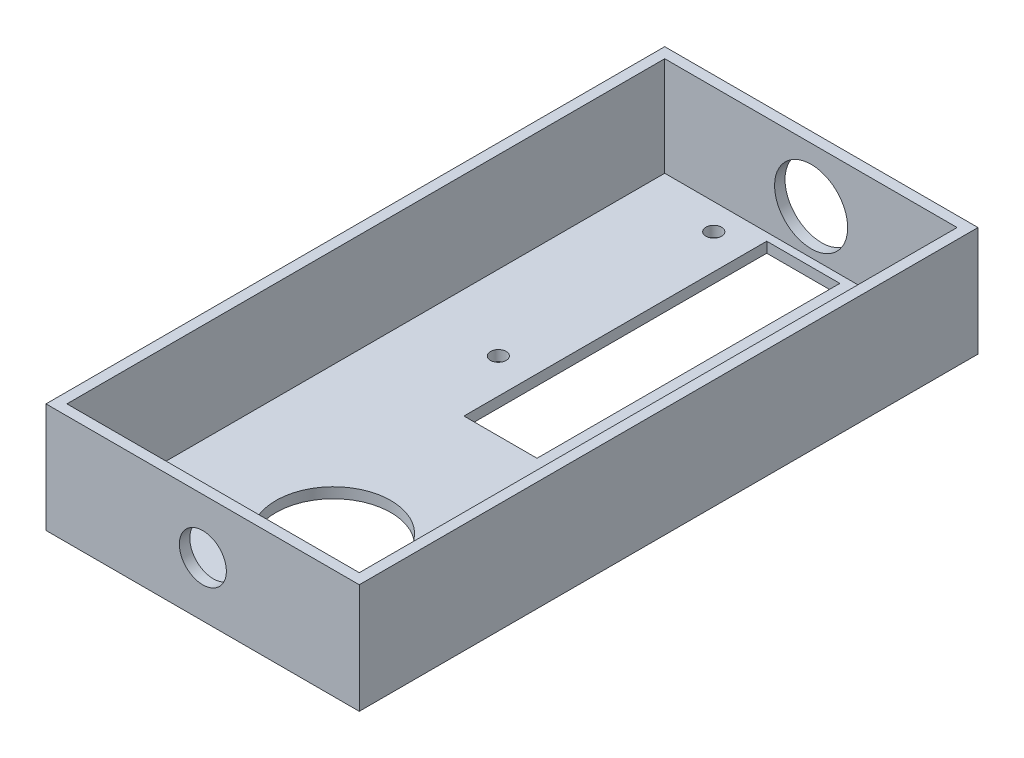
ISO-10303-21;
HEADER;
FILE_DESCRIPTION(('STEP AP214'),'2;1');
FILE_NAME('part.step','',(''),(''),'','','');
FILE_SCHEMA(('AUTOMOTIVE_DESIGN { 1 0 10303 214 1 1 1 1 }'));
ENDSEC;
DATA;
#1=APPLICATION_CONTEXT('core data for automotive mechanical design processes');
#2=APPLICATION_PROTOCOL_DEFINITION('international standard','automotive_design',2000,#1);
#3=PRODUCT_CONTEXT('',#1,'mechanical');
#4=PRODUCT('Part','Part','',(#3));
#5=PRODUCT_RELATED_PRODUCT_CATEGORY('part','',(#4));
#6=PRODUCT_DEFINITION_FORMATION('','',#4);
#7=PRODUCT_DEFINITION_CONTEXT('part definition',#1,'design');
#8=PRODUCT_DEFINITION('design','',#6,#7);
#9=PRODUCT_DEFINITION_SHAPE('','',#8);
#10=(LENGTH_UNIT() NAMED_UNIT(*) SI_UNIT(.MILLI.,.METRE.));
#11=(NAMED_UNIT(*) PLANE_ANGLE_UNIT() SI_UNIT($,.RADIAN.));
#12=(NAMED_UNIT(*) SI_UNIT($,.STERADIAN.) SOLID_ANGLE_UNIT());
#13=UNCERTAINTY_MEASURE_WITH_UNIT(LENGTH_MEASURE(1.E-05),#10,'distance_accuracy_value','');
#14=(GEOMETRIC_REPRESENTATION_CONTEXT(3) GLOBAL_UNCERTAINTY_ASSIGNED_CONTEXT((#13)) GLOBAL_UNIT_ASSIGNED_CONTEXT((#10,
#11,#12)) REPRESENTATION_CONTEXT('',''));
#15=CARTESIAN_POINT('',(0.,0.,0.));
#16=DIRECTION('',(0.,0.,1.));
#17=DIRECTION('',(1.,0.,0.));
#18=AXIS2_PLACEMENT_3D('',#15,#16,#17);
#19=CARTESIAN_POINT('',(0.,2.,0.));
#20=DIRECTION('',(0.,-1.,0.));
#21=DIRECTION('',(0.,0.,-1.));
#22=AXIS2_PLACEMENT_3D('',#19,#20,#21);
#23=PLANE('',#22);
#24=CARTESIAN_POINT('',(30.0395648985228,2.,-6.50255374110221));
#25=DIRECTION('',(0.,1.,0.));
#26=DIRECTION('',(0.,0.,1.));
#27=AXIS2_PLACEMENT_3D('',#24,#25,#26);
#28=CIRCLE('',#27,11.);
#29=CARTESIAN_POINT('',(30.0395648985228,2.,4.49744625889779));
#30=VERTEX_POINT('',#29);
#31=EDGE_CURVE('E184',#30,#30,#28,.T.);
#32=ORIENTED_EDGE('',*,*,#31,.F.);
#33=EDGE_LOOP('',(#32));
#34=FACE_BOUND('',#33,.T.);
#35=CARTESIAN_POINT('',(43.7551083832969,2.,-93.0025537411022));
#36=DIRECTION('',(0.,1.,0.));
#37=DIRECTION('',(0.,0.,1.));
#38=AXIS2_PLACEMENT_3D('',#35,#36,#37);
#39=CIRCLE('',#38,1.4999965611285);
#40=CARTESIAN_POINT('',(43.7551083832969,2.,-91.5025571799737));
#41=VERTEX_POINT('',#40);
#42=EDGE_CURVE('E196',#41,#41,#39,.T.);
#43=ORIENTED_EDGE('',*,*,#42,.F.);
#44=EDGE_LOOP('',(#43));
#45=FACE_BOUND('',#44,.T.);
#46=CARTESIAN_POINT('',(16.3670193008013,2.,-51.7685348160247));
#47=DIRECTION('',(0.,1.,0.));
#48=DIRECTION('',(0.,0.,1.));
#49=AXIS2_PLACEMENT_3D('',#46,#47,#48);
#50=CIRCLE('',#49,1.5);
#51=CARTESIAN_POINT('',(16.3670193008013,2.,-50.2685348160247));
#52=VERTEX_POINT('',#51);
#53=EDGE_CURVE('E195',#52,#52,#50,.T.);
#54=ORIENTED_EDGE('',*,*,#53,.F.);
#55=EDGE_LOOP('',(#54));
#56=FACE_BOUND('',#55,.T.);
#57=CARTESIAN_POINT('',(43.7389194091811,2.,-51.7685348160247));
#58=DIRECTION('',(0.,1.,0.));
#59=DIRECTION('',(0.,0.,1.));
#60=AXIS2_PLACEMENT_3D('',#57,#58,#59);
#61=CIRCLE('',#60,1.5);
#62=CARTESIAN_POINT('',(43.7389194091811,2.,-50.2685348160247));
#63=VERTEX_POINT('',#62);
#64=EDGE_CURVE('E190',#63,#63,#61,.T.);
#65=ORIENTED_EDGE('',*,*,#64,.F.);
#66=EDGE_LOOP('',(#65));
#67=FACE_BOUND('',#66,.T.);
#68=CARTESIAN_POINT('',(16.3883028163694,2.,-93.0025537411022));
#69=DIRECTION('',(0.,1.,0.));
#70=DIRECTION('',(0.,0.,1.));
#71=AXIS2_PLACEMENT_3D('',#68,#69,#70);
#72=CIRCLE('',#71,1.50500400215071);
#73=CARTESIAN_POINT('',(16.3883028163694,2.,-91.4975497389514));
#74=VERTEX_POINT('',#73);
#75=EDGE_CURVE('E199',#74,#74,#72,.T.);
#76=ORIENTED_EDGE('',*,*,#75,.F.);
#77=EDGE_LOOP('',(#76));
#78=FACE_BOUND('',#77,.T.);
#79=DIRECTION('',(1.,0.,0.));
#80=VECTOR('',#79,1.);
#81=CARTESIAN_POINT('',(23.0395648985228,2.,-38.5025537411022));
#82=LINE('',#81,#80);
#83=CARTESIAN_POINT('',(23.0395648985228,2.,-38.5025537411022));
#84=VERTEX_POINT('',#83);
#85=CARTESIAN_POINT('',(37.0395648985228,2.,-38.5025537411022));
#86=VERTEX_POINT('',#85);
#87=EDGE_CURVE('E215',#84,#86,#82,.T.);
#88=ORIENTED_EDGE('',*,*,#87,.F.);
#89=DIRECTION('',(0.,0.,1.));
#90=VECTOR('',#89,1.);
#91=CARTESIAN_POINT('',(23.0395648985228,2.,-96.5025537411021));
#92=LINE('',#91,#90);
#93=CARTESIAN_POINT('',(23.0395648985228,2.,-96.5025537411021));
#94=VERTEX_POINT('',#93);
#95=EDGE_CURVE('E213',#94,#84,#92,.T.);
#96=ORIENTED_EDGE('',*,*,#95,.F.);
#97=DIRECTION('',(-1.,0.,0.));
#98=VECTOR('',#97,1.);
#99=CARTESIAN_POINT('',(23.0395648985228,2.,-96.5025537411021));
#100=LINE('',#99,#98);
#101=CARTESIAN_POINT('',(37.0395648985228,2.,-96.5025537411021));
#102=VERTEX_POINT('',#101);
#103=EDGE_CURVE('E221',#102,#94,#100,.T.);
#104=ORIENTED_EDGE('',*,*,#103,.F.);
#105=DIRECTION('',(0.,0.,-1.));
#106=VECTOR('',#105,1.);
#107=CARTESIAN_POINT('',(37.0395648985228,2.,-96.5025537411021));
#108=LINE('',#107,#106);
#109=EDGE_CURVE('E218',#86,#102,#108,.T.);
#110=ORIENTED_EDGE('',*,*,#109,.F.);
#111=EDGE_LOOP('',(#88,#96,#104,#110));
#112=FACE_BOUND('',#111,.T.);
#113=DIRECTION('',(-1.,0.,0.));
#114=VECTOR('',#113,1.);
#115=CARTESIAN_POINT('',(0.,2.,16.4974462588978));
#116=LINE('',#115,#114);
#117=CARTESIAN_POINT('',(58.,2.,16.4974462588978));
#118=VERTEX_POINT('',#117);
#119=CARTESIAN_POINT('',(2.,2.,16.4974462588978));
#120=VERTEX_POINT('',#119);
#121=EDGE_CURVE('E176',#118,#120,#116,.T.);
#122=ORIENTED_EDGE('',*,*,#121,.F.);
#123=DIRECTION('',(0.,0.,1.));
#124=VECTOR('',#123,1.);
#125=CARTESIAN_POINT('',(58.,2.,40.));
#126=LINE('',#125,#124);
#127=CARTESIAN_POINT('',(58.,2.,-98.));
#128=VERTEX_POINT('',#127);
#129=EDGE_CURVE('E139',#128,#118,#126,.T.);
#130=ORIENTED_EDGE('',*,*,#129,.F.);
#131=DIRECTION('',(-1.,0.,0.));
#132=VECTOR('',#131,1.);
#133=CARTESIAN_POINT('',(60.,2.,-98.));
#134=LINE('',#133,#132);
#135=CARTESIAN_POINT('',(2.,2.,-98.));
#136=VERTEX_POINT('',#135);
#137=EDGE_CURVE('E138',#128,#136,#134,.T.);
#138=ORIENTED_EDGE('',*,*,#137,.T.);
#139=DIRECTION('',(0.,0.,-1.));
#140=VECTOR('',#139,1.);
#141=CARTESIAN_POINT('',(2.,2.,40.));
#142=LINE('',#141,#140);
#143=EDGE_CURVE('E182',#120,#136,#142,.T.);
#144=ORIENTED_EDGE('',*,*,#143,.F.);
#145=EDGE_LOOP('',(#122,#130,#138,#144));
#146=FACE_BOUND('',#145,.T.);
#147=ADVANCED_FACE('F43',(#34,#45,#56,#67,#78,#112,#146),#23,.F.);
#148=CARTESIAN_POINT('',(58.,32.,40.));
#149=DIRECTION('',(1.,0.,0.));
#150=DIRECTION('',(0.,0.,-1.));
#151=AXIS2_PLACEMENT_3D('',#148,#149,#150);
#152=PLANE('',#151);
#153=DIRECTION('',(0.,-1.,0.));
#154=VECTOR('',#153,1.);
#155=CARTESIAN_POINT('',(58.,32.,16.4974462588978));
#156=LINE('',#155,#154);
#157=CARTESIAN_POINT('',(58.,21.,16.4974462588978));
#158=VERTEX_POINT('',#157);
#159=EDGE_CURVE('E140',#158,#118,#156,.T.);
#160=ORIENTED_EDGE('',*,*,#159,.F.);
#161=DIRECTION('',(0.,0.,-1.));
#162=VECTOR('',#161,1.);
#163=CARTESIAN_POINT('',(58.,21.,16.4974462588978));
#164=LINE('',#163,#162);
#165=CARTESIAN_POINT('',(58.,21.,-98.));
#166=VERTEX_POINT('',#165);
#167=EDGE_CURVE('E143',#158,#166,#164,.T.);
#168=ORIENTED_EDGE('',*,*,#167,.T.);
#169=DIRECTION('',(0.,-1.,0.));
#170=VECTOR('',#169,1.);
#171=CARTESIAN_POINT('',(58.,32.,-98.));
#172=LINE('',#171,#170);
#173=EDGE_CURVE('E68',#166,#128,#172,.T.);
#174=ORIENTED_EDGE('',*,*,#173,.T.);
#175=ORIENTED_EDGE('',*,*,#129,.T.);
#176=EDGE_LOOP('',(#160,#168,#174,#175));
#177=FACE_BOUND('',#176,.T.);
#178=ADVANCED_FACE('F144',(#177),#152,.F.);
#179=CARTESIAN_POINT('',(2.,32.,40.));
#180=DIRECTION('',(-1.,0.,0.));
#181=DIRECTION('',(0.,0.,1.));
#182=AXIS2_PLACEMENT_3D('',#179,#180,#181);
#183=PLANE('',#182);
#184=DIRECTION('',(0.,-1.,0.));
#185=VECTOR('',#184,1.);
#186=CARTESIAN_POINT('',(2.,32.,-98.));
#187=LINE('',#186,#185);
#188=CARTESIAN_POINT('',(2.,21.,-98.));
#189=VERTEX_POINT('',#188);
#190=EDGE_CURVE('E60',#189,#136,#187,.T.);
#191=ORIENTED_EDGE('',*,*,#190,.F.);
#192=DIRECTION('',(0.,0.,1.));
#193=VECTOR('',#192,1.);
#194=CARTESIAN_POINT('',(2.,21.,16.4974462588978));
#195=LINE('',#194,#193);
#196=CARTESIAN_POINT('',(2.,21.,16.4974462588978));
#197=VERTEX_POINT('',#196);
#198=EDGE_CURVE('E151',#189,#197,#195,.T.);
#199=ORIENTED_EDGE('',*,*,#198,.T.);
#200=DIRECTION('',(0.,-1.,0.));
#201=VECTOR('',#200,1.);
#202=CARTESIAN_POINT('',(2.,32.,16.4974462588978));
#203=LINE('',#202,#201);
#204=EDGE_CURVE('E179',#197,#120,#203,.T.);
#205=ORIENTED_EDGE('',*,*,#204,.T.);
#206=ORIENTED_EDGE('',*,*,#143,.T.);
#207=EDGE_LOOP('',(#191,#199,#205,#206));
#208=FACE_BOUND('',#207,.T.);
#209=ADVANCED_FACE('F290',(#208),#183,.F.);
#210=CARTESIAN_POINT('',(0.,0.,-98.));
#211=DIRECTION('',(0.,0.,1.));
#212=DIRECTION('',(1.,0.,0.));
#213=AXIS2_PLACEMENT_3D('',#210,#211,#212);
#214=PLANE('',#213);
#215=ORIENTED_EDGE('',*,*,#173,.F.);
#216=DIRECTION('',(-1.,0.,0.));
#217=VECTOR('',#216,1.);
#218=CARTESIAN_POINT('',(58.,21.,-98.));
#219=LINE('',#218,#217);
#220=EDGE_CURVE('E135',#166,#189,#219,.T.);
#221=ORIENTED_EDGE('',*,*,#220,.T.);
#222=ORIENTED_EDGE('',*,*,#190,.T.);
#223=ORIENTED_EDGE('',*,*,#137,.F.);
#224=EDGE_LOOP('',(#215,#221,#222,#223));
#225=FACE_BOUND('',#224,.T.);
#226=CARTESIAN_POINT('',(30.0395648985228,10.5,-98.));
#227=DIRECTION('',(0.,0.,-1.));
#228=DIRECTION('',(-1.,0.,0.));
#229=AXIS2_PLACEMENT_3D('',#226,#227,#228);
#230=CIRCLE('',#229,7.);
#231=CARTESIAN_POINT('',(23.0395648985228,10.5,-98.));
#232=VERTEX_POINT('',#231);
#233=EDGE_CURVE('E205',#232,#232,#230,.T.);
#234=ORIENTED_EDGE('',*,*,#233,.T.);
#235=EDGE_LOOP('',(#234));
#236=FACE_BOUND('',#235,.T.);
#237=ADVANCED_FACE('F132',(#225,#236),#214,.T.);
#238=CARTESIAN_POINT('',(0.,2.,0.));
#239=DIRECTION('',(1.,0.,0.));
#240=DIRECTION('',(0.,0.,-1.));
#241=AXIS2_PLACEMENT_3D('',#238,#239,#240);
#242=PLANE('',#241);
#243=DIRECTION('',(0.,1.,0.));
#244=VECTOR('',#243,1.);
#245=CARTESIAN_POINT('',(0.,-2.00000000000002,18.5));
#246=LINE('',#245,#244);
#247=CARTESIAN_POINT('',(0.,0.,18.5));
#248=VERTEX_POINT('',#247);
#249=CARTESIAN_POINT('',(0.,21.,18.5));
#250=VERTEX_POINT('',#249);
#251=EDGE_CURVE('E170',#248,#250,#246,.T.);
#252=ORIENTED_EDGE('',*,*,#251,.T.);
#253=DIRECTION('',(0.,0.,1.));
#254=VECTOR('',#253,1.);
#255=CARTESIAN_POINT('',(0.,21.,-100.));
#256=LINE('',#255,#254);
#257=CARTESIAN_POINT('',(0.,21.,-100.));
#258=VERTEX_POINT('',#257);
#259=EDGE_CURVE('E157',#258,#250,#256,.T.);
#260=ORIENTED_EDGE('',*,*,#259,.F.);
#261=DIRECTION('',(0.,-1.,0.));
#262=VECTOR('',#261,1.);
#263=CARTESIAN_POINT('',(0.,2.,-100.));
#264=LINE('',#263,#262);
#265=CARTESIAN_POINT('',(0.,0.,-100.));
#266=VERTEX_POINT('',#265);
#267=EDGE_CURVE('E242',#258,#266,#264,.T.);
#268=ORIENTED_EDGE('',*,*,#267,.T.);
#269=DIRECTION('',(0.,0.,1.));
#270=VECTOR('',#269,1.);
#271=CARTESIAN_POINT('',(0.,0.,0.));
#272=LINE('',#271,#270);
#273=EDGE_CURVE('E227',#266,#248,#272,.T.);
#274=ORIENTED_EDGE('',*,*,#273,.T.);
#275=EDGE_LOOP('',(#252,#260,#268,#274));
#276=FACE_BOUND('',#275,.T.);
#277=ADVANCED_FACE('F45',(#276),#242,.F.);
#278=CARTESIAN_POINT('',(60.,2.,0.));
#279=DIRECTION('',(-1.,0.,0.));
#280=DIRECTION('',(0.,0.,1.));
#281=AXIS2_PLACEMENT_3D('',#278,#279,#280);
#282=PLANE('',#281);
#283=DIRECTION('',(0.,-1.,0.));
#284=VECTOR('',#283,1.);
#285=CARTESIAN_POINT('',(60.,2.,-100.));
#286=LINE('',#285,#284);
#287=CARTESIAN_POINT('',(60.,21.,-100.));
#288=VERTEX_POINT('',#287);
#289=CARTESIAN_POINT('',(60.,0.,-100.));
#290=VERTEX_POINT('',#289);
#291=EDGE_CURVE('E244',#288,#290,#286,.T.);
#292=ORIENTED_EDGE('',*,*,#291,.F.);
#293=DIRECTION('',(0.,0.,-1.));
#294=VECTOR('',#293,1.);
#295=CARTESIAN_POINT('',(60.,21.,-100.));
#296=LINE('',#295,#294);
#297=CARTESIAN_POINT('',(60.,21.,18.5));
#298=VERTEX_POINT('',#297);
#299=EDGE_CURVE('E163',#298,#288,#296,.T.);
#300=ORIENTED_EDGE('',*,*,#299,.F.);
#301=DIRECTION('',(0.,1.,0.));
#302=VECTOR('',#301,1.);
#303=CARTESIAN_POINT('',(60.,-2.00000000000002,18.5));
#304=LINE('',#303,#302);
#305=CARTESIAN_POINT('',(60.,0.,18.5));
#306=VERTEX_POINT('',#305);
#307=EDGE_CURVE('E169',#306,#298,#304,.T.);
#308=ORIENTED_EDGE('',*,*,#307,.F.);
#309=DIRECTION('',(0.,0.,-1.));
#310=VECTOR('',#309,1.);
#311=CARTESIAN_POINT('',(60.,0.,0.));
#312=LINE('',#311,#310);
#313=EDGE_CURVE('E236',#306,#290,#312,.T.);
#314=ORIENTED_EDGE('',*,*,#313,.T.);
#315=EDGE_LOOP('',(#292,#300,#308,#314));
#316=FACE_BOUND('',#315,.T.);
#317=ADVANCED_FACE('F303',(#316),#282,.F.);
#318=CARTESIAN_POINT('',(0.,2.,-100.));
#319=DIRECTION('',(0.,0.,1.));
#320=DIRECTION('',(1.,0.,0.));
#321=AXIS2_PLACEMENT_3D('',#318,#319,#320);
#322=PLANE('',#321);
#323=ORIENTED_EDGE('',*,*,#267,.F.);
#324=DIRECTION('',(-1.,0.,0.));
#325=VECTOR('',#324,1.);
#326=CARTESIAN_POINT('',(0.,21.,-100.));
#327=LINE('',#326,#325);
#328=EDGE_CURVE('E166',#288,#258,#327,.T.);
#329=ORIENTED_EDGE('',*,*,#328,.F.);
#330=ORIENTED_EDGE('',*,*,#291,.T.);
#331=DIRECTION('',(-1.,0.,0.));
#332=VECTOR('',#331,1.);
#333=CARTESIAN_POINT('',(0.,0.,-100.));
#334=LINE('',#333,#332);
#335=EDGE_CURVE('E239',#290,#266,#334,.T.);
#336=ORIENTED_EDGE('',*,*,#335,.T.);
#337=EDGE_LOOP('',(#323,#329,#330,#336));
#338=FACE_BOUND('',#337,.T.);
#339=CARTESIAN_POINT('',(30.0395648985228,10.5,-100.));
#340=DIRECTION('',(0.,0.,-1.));
#341=DIRECTION('',(-1.,0.,0.));
#342=AXIS2_PLACEMENT_3D('',#339,#340,#341);
#343=CIRCLE('',#342,7.);
#344=CARTESIAN_POINT('',(23.0395648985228,10.5,-100.));
#345=VERTEX_POINT('',#344);
#346=EDGE_CURVE('E208',#345,#345,#343,.T.);
#347=ORIENTED_EDGE('',*,*,#346,.F.);
#348=EDGE_LOOP('',(#347));
#349=FACE_BOUND('',#348,.T.);
#350=ADVANCED_FACE('F300',(#338,#349),#322,.F.);
#351=CARTESIAN_POINT('',(0.,0.,0.));
#352=DIRECTION('',(0.,-1.,0.));
#353=DIRECTION('',(0.,0.,-1.));
#354=AXIS2_PLACEMENT_3D('',#351,#352,#353);
#355=PLANE('',#354);
#356=DIRECTION('',(1.,0.,0.));
#357=VECTOR('',#356,1.);
#358=CARTESIAN_POINT('',(0.,0.,18.5));
#359=LINE('',#358,#357);
#360=EDGE_CURVE('E173',#248,#306,#359,.T.);
#361=ORIENTED_EDGE('',*,*,#360,.F.);
#362=ORIENTED_EDGE('',*,*,#273,.F.);
#363=ORIENTED_EDGE('',*,*,#335,.F.);
#364=ORIENTED_EDGE('',*,*,#313,.F.);
#365=EDGE_LOOP('',(#361,#362,#363,#364));
#366=FACE_BOUND('',#365,.T.);
#367=CARTESIAN_POINT('',(30.0395648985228,0.,-6.50255374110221));
#368=DIRECTION('',(0.,1.,0.));
#369=DIRECTION('',(0.,0.,1.));
#370=AXIS2_PLACEMENT_3D('',#367,#368,#369);
#371=CIRCLE('',#370,11.);
#372=CARTESIAN_POINT('',(30.0395648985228,0.,4.49744625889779));
#373=VERTEX_POINT('',#372);
#374=EDGE_CURVE('E187',#373,#373,#371,.T.);
#375=ORIENTED_EDGE('',*,*,#374,.T.);
#376=EDGE_LOOP('',(#375));
#377=FACE_BOUND('',#376,.T.);
#378=CARTESIAN_POINT('',(43.7551083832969,0.,-93.0025537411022));
#379=DIRECTION('',(0.,-1.,0.));
#380=DIRECTION('',(0.,0.,-1.));
#381=AXIS2_PLACEMENT_3D('',#378,#379,#380);
#382=CIRCLE('',#381,1.4999965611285);
#383=CARTESIAN_POINT('',(43.7551083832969,0.,-94.5025503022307));
#384=VERTEX_POINT('',#383);
#385=EDGE_CURVE('E211',#384,#384,#382,.T.);
#386=ORIENTED_EDGE('',*,*,#385,.F.);
#387=EDGE_LOOP('',(#386));
#388=FACE_BOUND('',#387,.T.);
#389=CARTESIAN_POINT('',(16.3670193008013,0.,-51.7685348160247));
#390=DIRECTION('',(0.,-1.,0.));
#391=DIRECTION('',(0.,0.,-1.));
#392=AXIS2_PLACEMENT_3D('',#389,#390,#391);
#393=CIRCLE('',#392,1.5);
#394=CARTESIAN_POINT('',(16.3670193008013,0.,-53.2685348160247));
#395=VERTEX_POINT('',#394);
#396=EDGE_CURVE('E257',#395,#395,#393,.T.);
#397=ORIENTED_EDGE('',*,*,#396,.F.);
#398=EDGE_LOOP('',(#397));
#399=FACE_BOUND('',#398,.T.);
#400=CARTESIAN_POINT('',(43.7389194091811,0.,-51.7685348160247));
#401=DIRECTION('',(0.,-1.,0.));
#402=DIRECTION('',(0.,0.,-1.));
#403=AXIS2_PLACEMENT_3D('',#400,#401,#402);
#404=CIRCLE('',#403,1.5);
#405=CARTESIAN_POINT('',(43.7389194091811,0.,-53.2685348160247));
#406=VERTEX_POINT('',#405);
#407=EDGE_CURVE('E254',#406,#406,#404,.T.);
#408=ORIENTED_EDGE('',*,*,#407,.F.);
#409=EDGE_LOOP('',(#408));
#410=FACE_BOUND('',#409,.T.);
#411=CARTESIAN_POINT('',(16.3883028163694,0.,-93.0025537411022));
#412=DIRECTION('',(0.,-1.,0.));
#413=DIRECTION('',(0.,0.,-1.));
#414=AXIS2_PLACEMENT_3D('',#411,#412,#413);
#415=CIRCLE('',#414,1.50500400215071);
#416=CARTESIAN_POINT('',(16.3883028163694,0.,-94.5075577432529));
#417=VERTEX_POINT('',#416);
#418=EDGE_CURVE('E204',#417,#417,#415,.T.);
#419=ORIENTED_EDGE('',*,*,#418,.F.);
#420=EDGE_LOOP('',(#419));
#421=FACE_BOUND('',#420,.T.);
#422=DIRECTION('',(0.,0.,-1.));
#423=VECTOR('',#422,1.);
#424=CARTESIAN_POINT('',(23.0395648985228,0.,0.));
#425=LINE('',#424,#423);
#426=CARTESIAN_POINT('',(23.0395648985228,0.,-38.5025537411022));
#427=VERTEX_POINT('',#426);
#428=CARTESIAN_POINT('',(23.0395648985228,0.,-96.5025537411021));
#429=VERTEX_POINT('',#428);
#430=EDGE_CURVE('E11',#427,#429,#425,.T.);
#431=ORIENTED_EDGE('',*,*,#430,.F.);
#432=DIRECTION('',(-1.,0.,0.));
#433=VECTOR('',#432,1.);
#434=CARTESIAN_POINT('',(0.,0.,-38.5025537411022));
#435=LINE('',#434,#433);
#436=CARTESIAN_POINT('',(37.0395648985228,0.,-38.5025537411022));
#437=VERTEX_POINT('',#436);
#438=EDGE_CURVE('E246',#437,#427,#435,.T.);
#439=ORIENTED_EDGE('',*,*,#438,.F.);
#440=DIRECTION('',(0.,0.,1.));
#441=VECTOR('',#440,1.);
#442=CARTESIAN_POINT('',(37.0395648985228,0.,0.));
#443=LINE('',#442,#441);
#444=CARTESIAN_POINT('',(37.0395648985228,0.,-96.5025537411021));
#445=VERTEX_POINT('',#444);
#446=EDGE_CURVE('E248',#445,#437,#443,.T.);
#447=ORIENTED_EDGE('',*,*,#446,.F.);
#448=DIRECTION('',(1.,0.,0.));
#449=VECTOR('',#448,1.);
#450=CARTESIAN_POINT('',(0.,0.,-96.5025537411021));
#451=LINE('',#450,#449);
#452=EDGE_CURVE('E52',#429,#445,#451,.T.);
#453=ORIENTED_EDGE('',*,*,#452,.F.);
#454=EDGE_LOOP('',(#431,#439,#447,#453));
#455=FACE_BOUND('',#454,.T.);
#456=ADVANCED_FACE('F298',(#366,#377,#388,#399,#410,#421,#455),#355,.T.);
#457=CARTESIAN_POINT('',(23.0395648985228,-8.,-96.5025537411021));
#458=DIRECTION('',(-1.,0.,0.));
#459=DIRECTION('',(0.,0.,1.));
#460=AXIS2_PLACEMENT_3D('',#457,#458,#459);
#461=PLANE('',#460);
#462=ORIENTED_EDGE('',*,*,#430,.T.);
#463=DIRECTION('',(0.,1.,0.));
#464=VECTOR('',#463,1.);
#465=CARTESIAN_POINT('',(23.0395648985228,-8.,-96.5025537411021));
#466=LINE('',#465,#464);
#467=EDGE_CURVE('E225',#429,#94,#466,.T.);
#468=ORIENTED_EDGE('',*,*,#467,.T.);
#469=ORIENTED_EDGE('',*,*,#95,.T.);
#470=DIRECTION('',(0.,1.,0.));
#471=VECTOR('',#470,1.);
#472=CARTESIAN_POINT('',(23.0395648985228,-8.,-38.5025537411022));
#473=LINE('',#472,#471);
#474=EDGE_CURVE('E224',#427,#84,#473,.T.);
#475=ORIENTED_EDGE('',*,*,#474,.F.);
#476=EDGE_LOOP('',(#462,#468,#469,#475));
#477=FACE_BOUND('',#476,.T.);
#478=ADVANCED_FACE('F296',(#477),#461,.F.);
#479=CARTESIAN_POINT('',(23.0395648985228,-8.,-96.5025537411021));
#480=DIRECTION('',(0.,0.,-1.));
#481=DIRECTION('',(-1.,0.,0.));
#482=AXIS2_PLACEMENT_3D('',#479,#480,#481);
#483=PLANE('',#482);
#484=ORIENTED_EDGE('',*,*,#452,.T.);
#485=DIRECTION('',(0.,1.,0.));
#486=VECTOR('',#485,1.);
#487=CARTESIAN_POINT('',(37.0395648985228,-8.,-96.5025537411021));
#488=LINE('',#487,#486);
#489=EDGE_CURVE('E228',#445,#102,#488,.T.);
#490=ORIENTED_EDGE('',*,*,#489,.T.);
#491=ORIENTED_EDGE('',*,*,#103,.T.);
#492=ORIENTED_EDGE('',*,*,#467,.F.);
#493=EDGE_LOOP('',(#484,#490,#491,#492));
#494=FACE_BOUND('',#493,.T.);
#495=ADVANCED_FACE('F343',(#494),#483,.F.);
#496=CARTESIAN_POINT('',(37.0395648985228,-8.,-96.5025537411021));
#497=DIRECTION('',(1.,0.,0.));
#498=DIRECTION('',(0.,0.,-1.));
#499=AXIS2_PLACEMENT_3D('',#496,#497,#498);
#500=PLANE('',#499);
#501=ORIENTED_EDGE('',*,*,#446,.T.);
#502=DIRECTION('',(0.,1.,0.));
#503=VECTOR('',#502,1.);
#504=CARTESIAN_POINT('',(37.0395648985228,-8.,-38.5025537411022));
#505=LINE('',#504,#503);
#506=EDGE_CURVE('E230',#437,#86,#505,.T.);
#507=ORIENTED_EDGE('',*,*,#506,.T.);
#508=ORIENTED_EDGE('',*,*,#109,.T.);
#509=ORIENTED_EDGE('',*,*,#489,.F.);
#510=EDGE_LOOP('',(#501,#507,#508,#509));
#511=FACE_BOUND('',#510,.T.);
#512=ADVANCED_FACE('F354',(#511),#500,.F.);
#513=CARTESIAN_POINT('',(23.0395648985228,-8.,-38.5025537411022));
#514=DIRECTION('',(0.,0.,1.));
#515=DIRECTION('',(1.,0.,0.));
#516=AXIS2_PLACEMENT_3D('',#513,#514,#515);
#517=PLANE('',#516);
#518=ORIENTED_EDGE('',*,*,#438,.T.);
#519=ORIENTED_EDGE('',*,*,#474,.T.);
#520=ORIENTED_EDGE('',*,*,#87,.T.);
#521=ORIENTED_EDGE('',*,*,#506,.F.);
#522=EDGE_LOOP('',(#518,#519,#520,#521));
#523=FACE_BOUND('',#522,.T.);
#524=ADVANCED_FACE('F352',(#523),#517,.F.);
#525=CARTESIAN_POINT('',(30.0395648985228,10.5,-98.));
#526=DIRECTION('',(0.,0.,-1.));
#527=DIRECTION('',(-1.,0.,0.));
#528=AXIS2_PLACEMENT_3D('',#525,#526,#527);
#529=CYLINDRICAL_SURFACE('',#528,7.);
#530=ORIENTED_EDGE('',*,*,#233,.F.);
#531=EDGE_LOOP('',(#530));
#532=FACE_BOUND('',#531,.T.);
#533=ORIENTED_EDGE('',*,*,#346,.T.);
#534=EDGE_LOOP('',(#533));
#535=FACE_BOUND('',#534,.T.);
#536=ADVANCED_FACE('F361',(#532,#535),#529,.F.);
#537=CARTESIAN_POINT('',(16.3883028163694,-1.,-93.0025537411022));
#538=DIRECTION('',(0.,1.,0.));
#539=DIRECTION('',(0.,0.,1.));
#540=AXIS2_PLACEMENT_3D('',#537,#538,#539);
#541=CYLINDRICAL_SURFACE('',#540,1.50500400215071);
#542=ORIENTED_EDGE('',*,*,#418,.T.);
#543=EDGE_LOOP('',(#542));
#544=FACE_BOUND('',#543,.T.);
#545=ORIENTED_EDGE('',*,*,#75,.T.);
#546=EDGE_LOOP('',(#545));
#547=FACE_BOUND('',#546,.T.);
#548=ADVANCED_FACE('F368',(#544,#547),#541,.F.);
#549=CARTESIAN_POINT('',(43.7389194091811,-1.,-51.7685348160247));
#550=DIRECTION('',(0.,1.,0.));
#551=DIRECTION('',(0.,0.,1.));
#552=AXIS2_PLACEMENT_3D('',#549,#550,#551);
#553=CYLINDRICAL_SURFACE('',#552,1.5);
#554=ORIENTED_EDGE('',*,*,#407,.T.);
#555=EDGE_LOOP('',(#554));
#556=FACE_BOUND('',#555,.T.);
#557=ORIENTED_EDGE('',*,*,#64,.T.);
#558=EDGE_LOOP('',(#557));
#559=FACE_BOUND('',#558,.T.);
#560=ADVANCED_FACE('F372',(#556,#559),#553,.F.);
#561=CARTESIAN_POINT('',(16.3670193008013,-1.,-51.7685348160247));
#562=DIRECTION('',(0.,1.,0.));
#563=DIRECTION('',(0.,0.,1.));
#564=AXIS2_PLACEMENT_3D('',#561,#562,#563);
#565=CYLINDRICAL_SURFACE('',#564,1.5);
#566=ORIENTED_EDGE('',*,*,#396,.T.);
#567=EDGE_LOOP('',(#566));
#568=FACE_BOUND('',#567,.T.);
#569=ORIENTED_EDGE('',*,*,#53,.T.);
#570=EDGE_LOOP('',(#569));
#571=FACE_BOUND('',#570,.T.);
#572=ADVANCED_FACE('F374',(#568,#571),#565,.F.);
#573=CARTESIAN_POINT('',(43.7551083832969,-1.,-93.0025537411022));
#574=DIRECTION('',(0.,1.,0.));
#575=DIRECTION('',(0.,0.,1.));
#576=AXIS2_PLACEMENT_3D('',#573,#574,#575);
#577=CYLINDRICAL_SURFACE('',#576,1.4999965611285);
#578=ORIENTED_EDGE('',*,*,#385,.T.);
#579=EDGE_LOOP('',(#578));
#580=FACE_BOUND('',#579,.T.);
#581=ORIENTED_EDGE('',*,*,#42,.T.);
#582=EDGE_LOOP('',(#581));
#583=FACE_BOUND('',#582,.T.);
#584=ADVANCED_FACE('F280',(#580,#583),#577,.F.);
#585=CARTESIAN_POINT('',(30.0395648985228,0.,-6.50255374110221));
#586=DIRECTION('',(0.,1.,0.));
#587=DIRECTION('',(0.,0.,1.));
#588=AXIS2_PLACEMENT_3D('',#585,#586,#587);
#589=CYLINDRICAL_SURFACE('',#588,11.);
#590=ORIENTED_EDGE('',*,*,#374,.F.);
#591=EDGE_LOOP('',(#590));
#592=FACE_BOUND('',#591,.T.);
#593=ORIENTED_EDGE('',*,*,#31,.T.);
#594=EDGE_LOOP('',(#593));
#595=FACE_BOUND('',#594,.T.);
#596=ADVANCED_FACE('F269',(#592,#595),#589,.F.);
#597=CARTESIAN_POINT('',(30.0395648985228,10.5,42.));
#598=DIRECTION('',(0.,0.,-1.));
#599=DIRECTION('',(-1.,0.,0.));
#600=AXIS2_PLACEMENT_3D('',#597,#598,#599);
#601=CYLINDRICAL_SURFACE('',#600,4.5);
#602=CARTESIAN_POINT('',(30.0395648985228,10.5,18.5));
#603=DIRECTION('',(0.,0.,-1.));
#604=DIRECTION('',(-1.,0.,0.));
#605=AXIS2_PLACEMENT_3D('',#602,#603,#604);
#606=CIRCLE('',#605,4.5);
#607=CARTESIAN_POINT('',(25.5395648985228,10.5,18.5));
#608=VERTEX_POINT('',#607);
#609=EDGE_CURVE('E47',#608,#608,#606,.F.);
#610=ORIENTED_EDGE('',*,*,#609,.T.);
#611=EDGE_LOOP('',(#610));
#612=FACE_BOUND('',#611,.T.);
#613=CARTESIAN_POINT('',(30.0395648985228,10.5,16.4974462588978));
#614=DIRECTION('',(0.,0.,1.));
#615=DIRECTION('',(1.,0.,0.));
#616=AXIS2_PLACEMENT_3D('',#613,#614,#615);
#617=CIRCLE('',#616,4.5);
#618=CARTESIAN_POINT('',(34.5395648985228,10.5,16.4974462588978));
#619=VERTEX_POINT('',#618);
#620=EDGE_CURVE('E175',#619,#619,#617,.T.);
#621=ORIENTED_EDGE('',*,*,#620,.F.);
#622=EDGE_LOOP('',(#621));
#623=FACE_BOUND('',#622,.T.);
#624=ADVANCED_FACE('F267',(#612,#623),#601,.F.);
#625=CARTESIAN_POINT('',(0.,32.,16.4974462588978));
#626=DIRECTION('',(0.,0.,1.));
#627=DIRECTION('',(1.,0.,0.));
#628=AXIS2_PLACEMENT_3D('',#625,#626,#627);
#629=PLANE('',#628);
#630=ORIENTED_EDGE('',*,*,#620,.T.);
#631=EDGE_LOOP('',(#630));
#632=FACE_BOUND('',#631,.T.);
#633=ORIENTED_EDGE('',*,*,#204,.F.);
#634=DIRECTION('',(1.,0.,0.));
#635=VECTOR('',#634,1.);
#636=CARTESIAN_POINT('',(58.,21.,16.4974462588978));
#637=LINE('',#636,#635);
#638=EDGE_CURVE('E153',#197,#158,#637,.T.);
#639=ORIENTED_EDGE('',*,*,#638,.T.);
#640=ORIENTED_EDGE('',*,*,#159,.T.);
#641=ORIENTED_EDGE('',*,*,#121,.T.);
#642=EDGE_LOOP('',(#633,#639,#640,#641));
#643=FACE_BOUND('',#642,.T.);
#644=ADVANCED_FACE('F264',(#632,#643),#629,.F.);
#645=CARTESIAN_POINT('',(60.,-2.00000000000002,18.5));
#646=DIRECTION('',(0.,0.,-1.));
#647=DIRECTION('',(-1.,0.,0.));
#648=AXIS2_PLACEMENT_3D('',#645,#646,#647);
#649=PLANE('',#648);
#650=ORIENTED_EDGE('',*,*,#307,.T.);
#651=DIRECTION('',(1.,0.,0.));
#652=VECTOR('',#651,1.);
#653=CARTESIAN_POINT('',(0.,21.,18.5));
#654=LINE('',#653,#652);
#655=EDGE_CURVE('E160',#250,#298,#654,.T.);
#656=ORIENTED_EDGE('',*,*,#655,.F.);
#657=ORIENTED_EDGE('',*,*,#251,.F.);
#658=ORIENTED_EDGE('',*,*,#360,.T.);
#659=EDGE_LOOP('',(#650,#656,#657,#658));
#660=FACE_BOUND('',#659,.T.);
#661=ORIENTED_EDGE('',*,*,#609,.F.);
#662=EDGE_LOOP('',(#661));
#663=FACE_BOUND('',#662,.T.);
#664=ADVANCED_FACE('F277',(#660,#663),#649,.F.);
#665=CARTESIAN_POINT('',(0.,21.,0.));
#666=DIRECTION('',(0.,1.,0.));
#667=DIRECTION('',(-1.,0.,0.));
#668=AXIS2_PLACEMENT_3D('',#665,#666,#667);
#669=PLANE('',#668);
#670=ORIENTED_EDGE('',*,*,#259,.T.);
#671=ORIENTED_EDGE('',*,*,#655,.T.);
#672=ORIENTED_EDGE('',*,*,#299,.T.);
#673=ORIENTED_EDGE('',*,*,#328,.T.);
#674=EDGE_LOOP('',(#670,#671,#672,#673));
#675=FACE_BOUND('',#674,.T.);
#676=ORIENTED_EDGE('',*,*,#220,.F.);
#677=ORIENTED_EDGE('',*,*,#167,.F.);
#678=ORIENTED_EDGE('',*,*,#638,.F.);
#679=ORIENTED_EDGE('',*,*,#198,.F.);
#680=EDGE_LOOP('',(#676,#677,#678,#679));
#681=FACE_BOUND('',#680,.T.);
#682=ADVANCED_FACE('F149',(#675,#681),#669,.T.);
#683=CLOSED_SHELL('',(#147,#178,#209,#237,#277,#317,#350,#456,#478,#495,#512,#524,#536,#548,
#560,#572,#584,#596,#624,#644,#664,#682));
#684=MANIFOLD_SOLID_BREP('B2',#683);
#685=ADVANCED_BREP_SHAPE_REPRESENTATION('',(#18,#684),#14);
#686=SHAPE_DEFINITION_REPRESENTATION(#9,#685);
ENDSEC;
END-ISO-10303-21;
